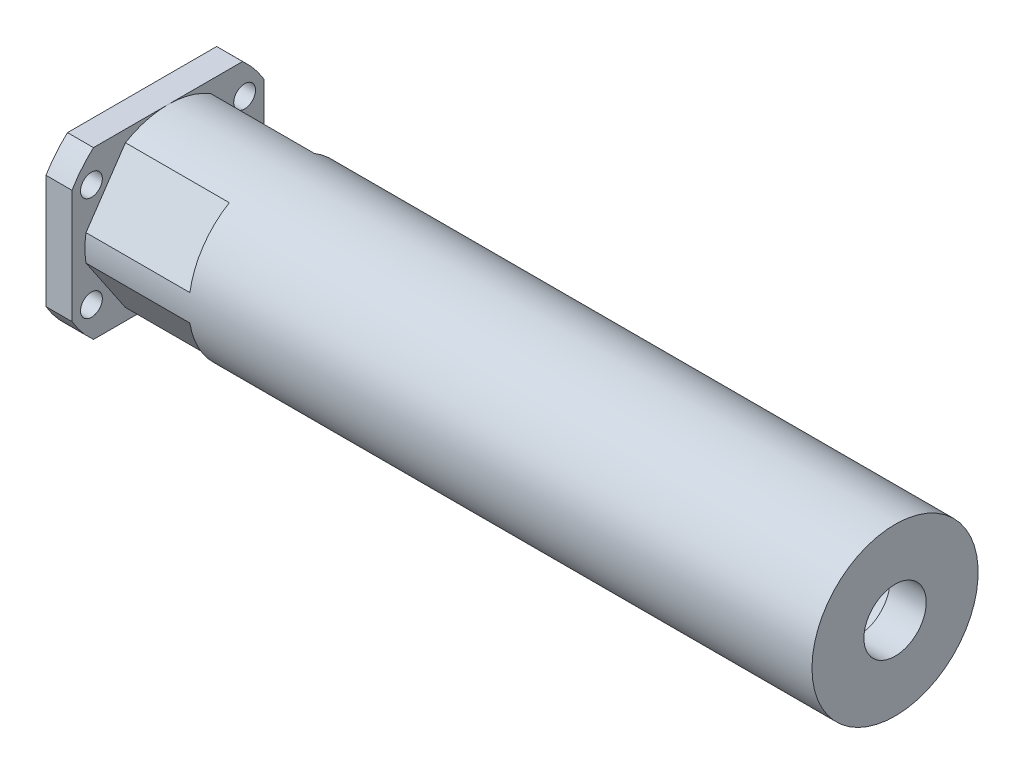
ISO-10303-21;
HEADER;
FILE_DESCRIPTION(('STEP AP214'),'2;1');
FILE_NAME('part.step','',(''),(''),'','','');
FILE_SCHEMA(('AUTOMOTIVE_DESIGN { 1 0 10303 214 1 1 1 1 }'));
ENDSEC;
DATA;
#1=APPLICATION_CONTEXT('core data for automotive mechanical design processes');
#2=APPLICATION_PROTOCOL_DEFINITION('international standard','automotive_design',2000,#1);
#3=PRODUCT_CONTEXT('',#1,'mechanical');
#4=PRODUCT('Part','Part','',(#3));
#5=PRODUCT_RELATED_PRODUCT_CATEGORY('part','',(#4));
#6=PRODUCT_DEFINITION_FORMATION('','',#4);
#7=PRODUCT_DEFINITION_CONTEXT('part definition',#1,'design');
#8=PRODUCT_DEFINITION('design','',#6,#7);
#9=PRODUCT_DEFINITION_SHAPE('','',#8);
#10=(LENGTH_UNIT() NAMED_UNIT(*) SI_UNIT(.MILLI.,.METRE.));
#11=(NAMED_UNIT(*) PLANE_ANGLE_UNIT() SI_UNIT($,.RADIAN.));
#12=(NAMED_UNIT(*) SI_UNIT($,.STERADIAN.) SOLID_ANGLE_UNIT());
#13=UNCERTAINTY_MEASURE_WITH_UNIT(LENGTH_MEASURE(1.E-05),#10,'distance_accuracy_value','');
#14=(GEOMETRIC_REPRESENTATION_CONTEXT(3) GLOBAL_UNCERTAINTY_ASSIGNED_CONTEXT((#13)) GLOBAL_UNIT_ASSIGNED_CONTEXT((#10,
#11,#12)) REPRESENTATION_CONTEXT('',''));
#15=CARTESIAN_POINT('',(0.,0.,0.));
#16=DIRECTION('',(0.,0.,1.));
#17=DIRECTION('',(1.,0.,0.));
#18=AXIS2_PLACEMENT_3D('',#15,#16,#17);
#19=CARTESIAN_POINT('',(-102.774315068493,0.,0.));
#20=DIRECTION('',(-1.,0.,0.));
#21=DIRECTION('',(0.,0.,1.));
#22=AXIS2_PLACEMENT_3D('',#19,#20,#21);
#23=CYLINDRICAL_SURFACE('',#22,13.25);
#24=CARTESIAN_POINT('',(0.,0.,0.));
#25=DIRECTION('',(-1.,0.,0.));
#26=DIRECTION('',(0.,0.,1.));
#27=AXIS2_PLACEMENT_3D('',#24,#25,#26);
#28=CIRCLE('',#27,13.25);
#29=CARTESIAN_POINT('',(0.,0.,13.25));
#30=VERTEX_POINT('',#29);
#31=EDGE_CURVE('E301',#30,#30,#28,.T.);
#32=ORIENTED_EDGE('',*,*,#31,.F.);
#33=EDGE_LOOP('',(#32));
#34=FACE_BOUND('',#33,.T.);
#35=CARTESIAN_POINT('',(-136.3,0.,0.));
#36=DIRECTION('',(-1.,0.,0.));
#37=DIRECTION('',(0.,0.,1.));
#38=AXIS2_PLACEMENT_3D('',#35,#36,#37);
#39=CIRCLE('',#38,13.25);
#40=CARTESIAN_POINT('',(-136.3,0.,13.25));
#41=VERTEX_POINT('',#40);
#42=EDGE_CURVE('E201',#41,#41,#39,.T.);
#43=ORIENTED_EDGE('',*,*,#42,.T.);
#44=EDGE_LOOP('',(#43));
#45=FACE_BOUND('',#44,.T.);
#46=ADVANCED_FACE('F63',(#34,#45),#23,.F.);
#47=CARTESIAN_POINT('',(-138.,13.2500000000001,0.));
#48=DIRECTION('',(1.,0.,0.));
#49=DIRECTION('',(0.,0.,-1.));
#50=AXIS2_PLACEMENT_3D('',#47,#48,#49);
#51=PLANE('',#50);
#52=CARTESIAN_POINT('',(-138.,-9.99984097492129,14.749765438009));
#53=DIRECTION('',(1.,0.,0.));
#54=DIRECTION('',(0.,0.,-1.));
#55=AXIS2_PLACEMENT_3D('',#52,#53,#54);
#56=CIRCLE('',#55,2.1);
#57=CARTESIAN_POINT('',(-138.,-9.99984097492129,12.649765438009));
#58=VERTEX_POINT('',#57);
#59=EDGE_CURVE('E216',#58,#58,#56,.F.);
#60=ORIENTED_EDGE('',*,*,#59,.F.);
#61=EDGE_LOOP('',(#60));
#62=FACE_BOUND('',#61,.T.);
#63=CARTESIAN_POINT('',(-138.,-7.99999999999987,-14.75));
#64=DIRECTION('',(1.,0.,0.));
#65=DIRECTION('',(0.,0.,-1.));
#66=AXIS2_PLACEMENT_3D('',#63,#64,#65);
#67=CIRCLE('',#66,2.09999999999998);
#68=CARTESIAN_POINT('',(-138.,-6.20805864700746,-13.6550359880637));
#69=VERTEX_POINT('',#68);
#70=CARTESIAN_POINT('',(-138.,-8.0595373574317,-12.6508441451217));
#71=VERTEX_POINT('',#70);
#72=EDGE_CURVE('E206',#69,#71,#67,.F.);
#73=ORIENTED_EDGE('',*,*,#72,.F.);
#74=CARTESIAN_POINT('',(-138.,0.,0.));
#75=DIRECTION('',(-1.,0.,0.));
#76=DIRECTION('',(0.,0.,1.));
#77=AXIS2_PLACEMENT_3D('',#74,#75,#76);
#78=CIRCLE('',#77,15.);
#79=EDGE_CURVE('E194',#71,#69,#78,.T.);
#80=ORIENTED_EDGE('',*,*,#79,.F.);
#81=EDGE_LOOP('',(#73,#80));
#82=FACE_BOUND('',#81,.T.);
#83=CARTESIAN_POINT('',(-138.,9.99984097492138,-14.7497654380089));
#84=DIRECTION('',(1.,0.,0.));
#85=DIRECTION('',(0.,0.,-1.));
#86=AXIS2_PLACEMENT_3D('',#83,#84,#85);
#87=CIRCLE('',#86,2.1);
#88=CARTESIAN_POINT('',(-138.,9.99984097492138,-16.8497654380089));
#89=VERTEX_POINT('',#88);
#90=EDGE_CURVE('E213',#89,#89,#87,.F.);
#91=ORIENTED_EDGE('',*,*,#90,.F.);
#92=EDGE_LOOP('',(#91));
#93=FACE_BOUND('',#92,.T.);
#94=CARTESIAN_POINT('',(-138.,9.99984097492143,14.7497654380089));
#95=DIRECTION('',(1.,0.,0.));
#96=DIRECTION('',(0.,0.,-1.));
#97=AXIS2_PLACEMENT_3D('',#94,#95,#96);
#98=CIRCLE('',#97,2.1);
#99=CARTESIAN_POINT('',(-138.,9.99984097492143,12.6497654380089));
#100=VERTEX_POINT('',#99);
#101=EDGE_CURVE('E225',#100,#100,#98,.F.);
#102=ORIENTED_EDGE('',*,*,#101,.F.);
#103=EDGE_LOOP('',(#102));
#104=FACE_BOUND('',#103,.T.);
#105=DIRECTION('',(0.,-1.,0.));
#106=VECTOR('',#105,1.);
#107=CARTESIAN_POINT('',(-138.,16.0000000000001,-18.5));
#108=LINE('',#107,#106);
#109=CARTESIAN_POINT('',(-138.,10.9544511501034,-18.5000000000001));
#110=VERTEX_POINT('',#109);
#111=CARTESIAN_POINT('',(-138.,-10.9544511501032,-18.5));
#112=VERTEX_POINT('',#111);
#113=EDGE_CURVE('E263',#110,#112,#108,.T.);
#114=ORIENTED_EDGE('',*,*,#113,.T.);
#115=CARTESIAN_POINT('',(-138.,0.,0.));
#116=DIRECTION('',(-1.,0.,0.));
#117=DIRECTION('',(0.,0.,1.));
#118=AXIS2_PLACEMENT_3D('',#115,#116,#117);
#119=CIRCLE('',#118,21.5);
#120=CARTESIAN_POINT('',(-138.,-15.9999999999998,-14.3614066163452));
#121=VERTEX_POINT('',#120);
#122=EDGE_CURVE('E460',#112,#121,#119,.T.);
#123=ORIENTED_EDGE('',*,*,#122,.T.);
#124=DIRECTION('',(0.,0.,1.));
#125=VECTOR('',#124,1.);
#126=CARTESIAN_POINT('',(-138.,-15.9999999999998,-18.5000000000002));
#127=LINE('',#126,#125);
#128=CARTESIAN_POINT('',(-138.,-15.9999999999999,14.3614066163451));
#129=VERTEX_POINT('',#128);
#130=EDGE_CURVE('E266',#121,#129,#127,.T.);
#131=ORIENTED_EDGE('',*,*,#130,.T.);
#132=CARTESIAN_POINT('',(-138.,-10.9544511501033,18.4999999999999));
#133=VERTEX_POINT('',#132);
#134=EDGE_CURVE('E317',#129,#133,#119,.T.);
#135=ORIENTED_EDGE('',*,*,#134,.T.);
#136=DIRECTION('',(0.,1.,0.));
#137=VECTOR('',#136,1.);
#138=CARTESIAN_POINT('',(-138.,16.,18.4999999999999));
#139=LINE('',#138,#137);
#140=CARTESIAN_POINT('',(-138.,10.9544511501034,18.5));
#141=VERTEX_POINT('',#140);
#142=EDGE_CURVE('E269',#133,#141,#139,.T.);
#143=ORIENTED_EDGE('',*,*,#142,.T.);
#144=CARTESIAN_POINT('',(-138.,16.,14.3614066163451));
#145=VERTEX_POINT('',#144);
#146=EDGE_CURVE('E319',#141,#145,#119,.T.);
#147=ORIENTED_EDGE('',*,*,#146,.T.);
#148=DIRECTION('',(0.,0.,-1.));
#149=VECTOR('',#148,1.);
#150=CARTESIAN_POINT('',(-138.,16.0000000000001,-18.5));
#151=LINE('',#150,#149);
#152=CARTESIAN_POINT('',(-138.,16.0000000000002,-14.3614066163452));
#153=VERTEX_POINT('',#152);
#154=EDGE_CURVE('E272',#145,#153,#151,.T.);
#155=ORIENTED_EDGE('',*,*,#154,.T.);
#156=EDGE_CURVE('E323',#153,#110,#119,.T.);
#157=ORIENTED_EDGE('',*,*,#156,.T.);
#158=EDGE_LOOP('',(#114,#123,#131,#135,#143,#147,#155,#157));
#159=FACE_BOUND('',#158,.T.);
#160=ADVANCED_FACE('F65',(#62,#82,#93,#104,#159),#51,.F.);
#161=CARTESIAN_POINT('',(-102.774315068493,0.,0.));
#162=DIRECTION('',(-1.,0.,0.));
#163=DIRECTION('',(0.,0.,1.));
#164=AXIS2_PLACEMENT_3D('',#161,#162,#163);
#165=CYLINDRICAL_SURFACE('',#164,21.5);
#166=DIRECTION('',(-1.,0.,0.));
#167=VECTOR('',#166,1.);
#168=CARTESIAN_POINT('',(-102.774315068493,-10.954451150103,-18.5));
#169=LINE('',#168,#167);
#170=CARTESIAN_POINT('',(-133.,-10.9544511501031,-18.5));
#171=VERTEX_POINT('',#170);
#172=EDGE_CURVE('E295',#171,#112,#169,.T.);
#173=ORIENTED_EDGE('',*,*,#172,.F.);
#174=CARTESIAN_POINT('',(-133.,0.,1.11022302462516E-13));
#175=DIRECTION('',(-1.,0.,0.));
#176=DIRECTION('',(0.,0.,1.));
#177=AXIS2_PLACEMENT_3D('',#174,#175,#176);
#178=CIRCLE('',#177,21.5);
#179=CARTESIAN_POINT('',(-133.,-15.9999999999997,-14.3614066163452));
#180=VERTEX_POINT('',#179);
#181=EDGE_CURVE('E468',#171,#180,#178,.T.);
#182=ORIENTED_EDGE('',*,*,#181,.T.);
#183=DIRECTION('',(-1.,0.,0.));
#184=VECTOR('',#183,1.);
#185=CARTESIAN_POINT('',(-102.774315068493,-15.9999999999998,-14.3614066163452));
#186=LINE('',#185,#184);
#187=EDGE_CURVE('E280',#121,#180,#186,.F.);
#188=ORIENTED_EDGE('',*,*,#187,.F.);
#189=ORIENTED_EDGE('',*,*,#122,.F.);
#190=EDGE_LOOP('',(#173,#182,#188,#189));
#191=FACE_BOUND('',#190,.T.);
#192=ADVANCED_FACE('F413',(#191),#165,.T.);
#193=DIRECTION('',(-1.,0.,0.));
#194=VECTOR('',#193,1.);
#195=CARTESIAN_POINT('',(-102.774315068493,10.9544511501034,-18.5000000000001));
#196=LINE('',#195,#194);
#197=CARTESIAN_POINT('',(-133.,10.9544511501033,-18.5000000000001));
#198=VERTEX_POINT('',#197);
#199=EDGE_CURVE('E293',#110,#198,#196,.F.);
#200=ORIENTED_EDGE('',*,*,#199,.F.);
#201=ORIENTED_EDGE('',*,*,#156,.F.);
#202=DIRECTION('',(-1.,0.,0.));
#203=VECTOR('',#202,1.);
#204=CARTESIAN_POINT('',(-102.774315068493,16.0000000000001,-14.3614066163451));
#205=LINE('',#204,#203);
#206=CARTESIAN_POINT('',(-133.,16.0000000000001,-14.3614066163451));
#207=VERTEX_POINT('',#206);
#208=EDGE_CURVE('E284',#207,#153,#205,.T.);
#209=ORIENTED_EDGE('',*,*,#208,.F.);
#210=EDGE_CURVE('E318',#207,#198,#178,.T.);
#211=ORIENTED_EDGE('',*,*,#210,.T.);
#212=EDGE_LOOP('',(#200,#201,#209,#211));
#213=FACE_BOUND('',#212,.T.);
#214=ADVANCED_FACE('F435',(#213),#165,.T.);
#215=DIRECTION('',(-1.,0.,0.));
#216=VECTOR('',#215,1.);
#217=CARTESIAN_POINT('',(-102.774315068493,16.,14.3614066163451));
#218=LINE('',#217,#216);
#219=CARTESIAN_POINT('',(-133.,16.,14.3614066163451));
#220=VERTEX_POINT('',#219);
#221=EDGE_CURVE('E287',#145,#220,#218,.F.);
#222=ORIENTED_EDGE('',*,*,#221,.F.);
#223=ORIENTED_EDGE('',*,*,#146,.F.);
#224=DIRECTION('',(-1.,0.,0.));
#225=VECTOR('',#224,1.);
#226=CARTESIAN_POINT('',(-102.774315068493,10.9544511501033,18.5));
#227=LINE('',#226,#225);
#228=CARTESIAN_POINT('',(-133.,10.9544511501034,18.4999999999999));
#229=VERTEX_POINT('',#228);
#230=EDGE_CURVE('E291',#229,#141,#227,.T.);
#231=ORIENTED_EDGE('',*,*,#230,.F.);
#232=EDGE_CURVE('E314',#229,#220,#178,.T.);
#233=ORIENTED_EDGE('',*,*,#232,.T.);
#234=EDGE_LOOP('',(#222,#223,#231,#233));
#235=FACE_BOUND('',#234,.T.);
#236=ADVANCED_FACE('F440',(#235),#165,.T.);
#237=DIRECTION('',(-1.,0.,0.));
#238=VECTOR('',#237,1.);
#239=CARTESIAN_POINT('',(-102.774315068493,-10.9544511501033,18.5));
#240=LINE('',#239,#238);
#241=CARTESIAN_POINT('',(-133.,-10.9544511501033,18.4999999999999));
#242=VERTEX_POINT('',#241);
#243=EDGE_CURVE('E289',#133,#242,#240,.F.);
#244=ORIENTED_EDGE('',*,*,#243,.F.);
#245=ORIENTED_EDGE('',*,*,#134,.F.);
#246=DIRECTION('',(-1.,0.,0.));
#247=VECTOR('',#246,1.);
#248=CARTESIAN_POINT('',(-102.774315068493,-16.,14.3614066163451));
#249=LINE('',#248,#247);
#250=CARTESIAN_POINT('',(-133.,-16.,14.361406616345));
#251=VERTEX_POINT('',#250);
#252=EDGE_CURVE('E277',#251,#129,#249,.T.);
#253=ORIENTED_EDGE('',*,*,#252,.F.);
#254=EDGE_CURVE('E311',#251,#242,#178,.T.);
#255=ORIENTED_EDGE('',*,*,#254,.T.);
#256=EDGE_LOOP('',(#244,#245,#253,#255));
#257=FACE_BOUND('',#256,.T.);
#258=ADVANCED_FACE('F432',(#257),#165,.T.);
#259=CARTESIAN_POINT('',(-133.,21.5,0.));
#260=DIRECTION('',(-1.,0.,0.));
#261=DIRECTION('',(0.,0.,1.));
#262=AXIS2_PLACEMENT_3D('',#259,#260,#261);
#263=PLANE('',#262);
#264=CARTESIAN_POINT('',(-133.,-7.99999999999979,-14.75));
#265=DIRECTION('',(1.,0.,0.));
#266=DIRECTION('',(0.,0.,-1.));
#267=AXIS2_PLACEMENT_3D('',#264,#265,#266);
#268=CIRCLE('',#267,2.09999999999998);
#269=CARTESIAN_POINT('',(-133.,-7.99999999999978,-16.85));
#270=VERTEX_POINT('',#269);
#271=EDGE_CURVE('E210',#270,#270,#268,.T.);
#272=ORIENTED_EDGE('',*,*,#271,.F.);
#273=EDGE_LOOP('',(#272));
#274=FACE_BOUND('',#273,.T.);
#275=CARTESIAN_POINT('',(-133.,9.99984097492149,-14.749765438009));
#276=DIRECTION('',(1.,0.,0.));
#277=DIRECTION('',(0.,0.,-1.));
#278=AXIS2_PLACEMENT_3D('',#275,#276,#277);
#279=CIRCLE('',#278,2.1);
#280=CARTESIAN_POINT('',(-133.,9.99984097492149,-16.849765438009));
#281=VERTEX_POINT('',#280);
#282=EDGE_CURVE('E209',#281,#281,#279,.T.);
#283=ORIENTED_EDGE('',*,*,#282,.F.);
#284=EDGE_LOOP('',(#283));
#285=FACE_BOUND('',#284,.T.);
#286=DIRECTION('',(0.,-1.,0.));
#287=VECTOR('',#286,1.);
#288=CARTESIAN_POINT('',(-133.,21.5000000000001,-18.5));
#289=LINE('',#288,#287);
#290=EDGE_CURVE('E327',#198,#171,#289,.T.);
#291=ORIENTED_EDGE('',*,*,#290,.F.);
#292=ORIENTED_EDGE('',*,*,#210,.F.);
#293=DIRECTION('',(0.,0.,-1.));
#294=VECTOR('',#293,1.);
#295=CARTESIAN_POINT('',(-133.,16.0000000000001,1.11022302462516E-13));
#296=LINE('',#295,#294);
#297=CARTESIAN_POINT('',(-133.,16.0000000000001,1.11022302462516E-13));
#298=VERTEX_POINT('',#297);
#299=EDGE_CURVE('E282',#298,#207,#296,.T.);
#300=ORIENTED_EDGE('',*,*,#299,.F.);
#301=CARTESIAN_POINT('',(-133.,0.,1.11022302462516E-13));
#302=DIRECTION('',(-1.,0.,0.));
#303=DIRECTION('',(0.,0.,1.));
#304=AXIS2_PLACEMENT_3D('',#301,#302,#303);
#305=CIRCLE('',#304,16.);
#306=CARTESIAN_POINT('',(-133.,13.7353119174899,-8.20616880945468));
#307=VERTEX_POINT('',#306);
#308=EDGE_CURVE('E308',#298,#307,#305,.T.);
#309=ORIENTED_EDGE('',*,*,#308,.T.);
#310=DIRECTION('',(0.,0.827708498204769,0.561158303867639));
#311=VECTOR('',#310,1.);
#312=CARTESIAN_POINT('',(-133.,13.7353119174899,-8.20616880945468));
#313=LINE('',#312,#311);
#314=CARTESIAN_POINT('',(-133.,2.53827889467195,-15.7973776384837));
#315=VERTEX_POINT('',#314);
#316=EDGE_CURVE('E234',#315,#307,#313,.T.);
#317=ORIENTED_EDGE('',*,*,#316,.F.);
#318=CARTESIAN_POINT('',(-133.,0.134268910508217,-15.9994366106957));
#319=VERTEX_POINT('',#318);
#320=EDGE_CURVE('E312',#315,#319,#305,.T.);
#321=ORIENTED_EDGE('',*,*,#320,.T.);
#322=DIRECTION('',(0.,0.879031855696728,-0.476763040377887));
#323=VECTOR('',#322,1.);
#324=CARTESIAN_POINT('',(-133.,0.134268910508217,-15.9994366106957));
#325=LINE('',#324,#323);
#326=CARTESIAN_POINT('',(-133.,-13.4836340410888,-8.61345534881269));
#327=VERTEX_POINT('',#326);
#328=EDGE_CURVE('E232',#327,#319,#325,.T.);
#329=ORIENTED_EDGE('',*,*,#328,.F.);
#330=CARTESIAN_POINT('',(-133.,-16.,-1.11022302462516E-13));
#331=VERTEX_POINT('',#330);
#332=EDGE_CURVE('E359',#327,#331,#305,.T.);
#333=ORIENTED_EDGE('',*,*,#332,.T.);
#334=DIRECTION('',(0.,0.,1.));
#335=VECTOR('',#334,1.);
#336=CARTESIAN_POINT('',(-133.,-16.,-1.11022302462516E-13));
#337=LINE('',#336,#335);
#338=EDGE_CURVE('E278',#180,#331,#337,.T.);
#339=ORIENTED_EDGE('',*,*,#338,.F.);
#340=ORIENTED_EDGE('',*,*,#181,.F.);
#341=EDGE_LOOP('',(#291,#292,#300,#309,#317,#321,#329,#333,#339,#340));
#342=FACE_BOUND('',#341,.T.);
#343=ADVANCED_FACE('F357',(#274,#285,#342),#263,.F.);
#344=CARTESIAN_POINT('',(-133.,-9.99984097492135,14.749765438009));
#345=DIRECTION('',(1.,0.,0.));
#346=DIRECTION('',(0.,0.,-1.));
#347=AXIS2_PLACEMENT_3D('',#344,#345,#346);
#348=CIRCLE('',#347,2.1);
#349=CARTESIAN_POINT('',(-133.,-9.99984097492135,12.649765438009));
#350=VERTEX_POINT('',#349);
#351=EDGE_CURVE('E604',#350,#350,#348,.T.);
#352=ORIENTED_EDGE('',*,*,#351,.F.);
#353=EDGE_LOOP('',(#352));
#354=FACE_BOUND('',#353,.T.);
#355=CARTESIAN_POINT('',(-133.,9.99984097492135,14.7497654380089));
#356=DIRECTION('',(1.,0.,0.));
#357=DIRECTION('',(0.,0.,-1.));
#358=AXIS2_PLACEMENT_3D('',#355,#356,#357);
#359=CIRCLE('',#358,2.1);
#360=CARTESIAN_POINT('',(-133.,9.99984097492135,12.6497654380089));
#361=VERTEX_POINT('',#360);
#362=EDGE_CURVE('E222',#361,#361,#359,.T.);
#363=ORIENTED_EDGE('',*,*,#362,.F.);
#364=EDGE_LOOP('',(#363));
#365=FACE_BOUND('',#364,.T.);
#366=EDGE_CURVE('E285',#220,#298,#296,.T.);
#367=ORIENTED_EDGE('',*,*,#366,.F.);
#368=ORIENTED_EDGE('',*,*,#232,.F.);
#369=DIRECTION('',(0.,1.,0.));
#370=VECTOR('',#369,1.);
#371=CARTESIAN_POINT('',(-133.,21.5,18.5));
#372=LINE('',#371,#370);
#373=EDGE_CURVE('E322',#242,#229,#372,.T.);
#374=ORIENTED_EDGE('',*,*,#373,.F.);
#375=ORIENTED_EDGE('',*,*,#254,.F.);
#376=EDGE_CURVE('E275',#331,#251,#337,.T.);
#377=ORIENTED_EDGE('',*,*,#376,.F.);
#378=CARTESIAN_POINT('',(-133.,-13.7353119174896,8.20616880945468));
#379=VERTEX_POINT('',#378);
#380=EDGE_CURVE('E313',#331,#379,#305,.T.);
#381=ORIENTED_EDGE('',*,*,#380,.T.);
#382=DIRECTION('',(0.,-0.827708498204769,-0.561158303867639));
#383=VECTOR('',#382,1.);
#384=CARTESIAN_POINT('',(-133.,-13.7353119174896,8.20616880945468));
#385=LINE('',#384,#383);
#386=CARTESIAN_POINT('',(-133.,-2.53827889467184,15.7973776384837));
#387=VERTEX_POINT('',#386);
#388=EDGE_CURVE('E230',#387,#379,#385,.T.);
#389=ORIENTED_EDGE('',*,*,#388,.F.);
#390=CARTESIAN_POINT('',(-133.,2.5382788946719,15.7973776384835));
#391=VERTEX_POINT('',#390);
#392=EDGE_CURVE('E364',#387,#391,#305,.T.);
#393=ORIENTED_EDGE('',*,*,#392,.T.);
#394=DIRECTION('',(0.,-0.827708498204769,0.56115830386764));
#395=VECTOR('',#394,1.);
#396=CARTESIAN_POINT('',(-133.,13.7353119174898,8.20616880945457));
#397=LINE('',#396,#395);
#398=CARTESIAN_POINT('',(-133.,13.7353119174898,8.20616880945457));
#399=VERTEX_POINT('',#398);
#400=EDGE_CURVE('E228',#399,#391,#397,.T.);
#401=ORIENTED_EDGE('',*,*,#400,.F.);
#402=EDGE_CURVE('E307',#399,#298,#305,.T.);
#403=ORIENTED_EDGE('',*,*,#402,.T.);
#404=EDGE_LOOP('',(#367,#368,#374,#375,#377,#381,#389,#393,#401,#403));
#405=FACE_BOUND('',#404,.T.);
#406=ADVANCED_FACE('F372',(#354,#365,#405),#263,.F.);
#407=CARTESIAN_POINT('',(-102.774315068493,0.,0.));
#408=DIRECTION('',(-1.,0.,0.));
#409=DIRECTION('',(0.,0.,1.));
#410=AXIS2_PLACEMENT_3D('',#407,#408,#409);
#411=CYLINDRICAL_SURFACE('',#410,16.);
#412=CARTESIAN_POINT('',(-113.,0.,0.));
#413=DIRECTION('',(1.,0.,0.));
#414=DIRECTION('',(0.,0.,-1.));
#415=AXIS2_PLACEMENT_3D('',#412,#413,#414);
#416=CIRCLE('',#415,16.);
#417=CARTESIAN_POINT('',(-113.,2.53827889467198,-15.7973776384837));
#418=VERTEX_POINT('',#417);
#419=CARTESIAN_POINT('',(-113.,13.7353119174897,-8.20616880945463));
#420=VERTEX_POINT('',#419);
#421=EDGE_CURVE('E329',#418,#420,#416,.T.);
#422=ORIENTED_EDGE('',*,*,#421,.T.);
#423=DIRECTION('',(-1.,0.,0.));
#424=VECTOR('',#423,1.);
#425=CARTESIAN_POINT('',(-113.,13.7353119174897,-8.20616880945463));
#426=LINE('',#425,#424);
#427=EDGE_CURVE('E243',#420,#307,#426,.T.);
#428=ORIENTED_EDGE('',*,*,#427,.T.);
#429=ORIENTED_EDGE('',*,*,#308,.F.);
#430=ORIENTED_EDGE('',*,*,#402,.F.);
#431=DIRECTION('',(-1.,0.,0.));
#432=VECTOR('',#431,1.);
#433=CARTESIAN_POINT('',(-113.,13.7353119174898,8.20616880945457));
#434=LINE('',#433,#432);
#435=CARTESIAN_POINT('',(-113.,13.7353119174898,8.20616880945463));
#436=VERTEX_POINT('',#435);
#437=EDGE_CURVE('E261',#436,#399,#434,.T.);
#438=ORIENTED_EDGE('',*,*,#437,.F.);
#439=CARTESIAN_POINT('',(-113.,2.53827889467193,15.7973776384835));
#440=VERTEX_POINT('',#439);
#441=EDGE_CURVE('E333',#436,#440,#416,.T.);
#442=ORIENTED_EDGE('',*,*,#441,.T.);
#443=DIRECTION('',(-1.,0.,0.));
#444=VECTOR('',#443,1.);
#445=CARTESIAN_POINT('',(-113.,2.53827889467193,15.7973776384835));
#446=LINE('',#445,#444);
#447=EDGE_CURVE('E258',#440,#391,#446,.T.);
#448=ORIENTED_EDGE('',*,*,#447,.T.);
#449=ORIENTED_EDGE('',*,*,#392,.F.);
#450=DIRECTION('',(-1.,0.,0.));
#451=VECTOR('',#450,1.);
#452=CARTESIAN_POINT('',(-113.,-2.53827889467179,15.7973776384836));
#453=LINE('',#452,#451);
#454=CARTESIAN_POINT('',(-113.,-2.53827889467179,15.7973776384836));
#455=VERTEX_POINT('',#454);
#456=EDGE_CURVE('E256',#455,#387,#453,.T.);
#457=ORIENTED_EDGE('',*,*,#456,.F.);
#458=CARTESIAN_POINT('',(-113.,-13.7353119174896,8.20616880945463));
#459=VERTEX_POINT('',#458);
#460=EDGE_CURVE('E335',#455,#459,#416,.T.);
#461=ORIENTED_EDGE('',*,*,#460,.T.);
#462=DIRECTION('',(-1.,0.,0.));
#463=VECTOR('',#462,1.);
#464=CARTESIAN_POINT('',(-113.,-13.7353119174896,8.20616880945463));
#465=LINE('',#464,#463);
#466=EDGE_CURVE('E253',#459,#379,#465,.T.);
#467=ORIENTED_EDGE('',*,*,#466,.T.);
#468=ORIENTED_EDGE('',*,*,#380,.F.);
#469=ORIENTED_EDGE('',*,*,#332,.F.);
#470=DIRECTION('',(-1.,0.,0.));
#471=VECTOR('',#470,1.);
#472=CARTESIAN_POINT('',(-113.,-13.4836340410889,-8.61345534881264));
#473=LINE('',#472,#471);
#474=CARTESIAN_POINT('',(-113.,-13.4836340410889,-8.61345534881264));
#475=VERTEX_POINT('',#474);
#476=EDGE_CURVE('E251',#475,#327,#473,.T.);
#477=ORIENTED_EDGE('',*,*,#476,.F.);
#478=CARTESIAN_POINT('',(-113.,0.134268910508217,-15.9994366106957));
#479=VERTEX_POINT('',#478);
#480=EDGE_CURVE('E332',#475,#479,#416,.T.);
#481=ORIENTED_EDGE('',*,*,#480,.T.);
#482=DIRECTION('',(-1.,0.,0.));
#483=VECTOR('',#482,1.);
#484=CARTESIAN_POINT('',(-113.,0.134268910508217,-15.9994366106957));
#485=LINE('',#484,#483);
#486=EDGE_CURVE('E248',#479,#319,#485,.T.);
#487=ORIENTED_EDGE('',*,*,#486,.T.);
#488=ORIENTED_EDGE('',*,*,#320,.F.);
#489=DIRECTION('',(-1.,0.,0.));
#490=VECTOR('',#489,1.);
#491=CARTESIAN_POINT('',(-113.,2.53827889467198,-15.7973776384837));
#492=LINE('',#491,#490);
#493=EDGE_CURVE('E246',#418,#315,#492,.T.);
#494=ORIENTED_EDGE('',*,*,#493,.F.);
#495=EDGE_LOOP('',(#422,#428,#429,#430,#438,#442,#448,#449,#457,#461,#467,#468,#469,#477,#481,
#487,#488,#494));
#496=FACE_BOUND('',#495,.T.);
#497=CARTESIAN_POINT('',(7.00000000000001,0.,0.));
#498=DIRECTION('',(-1.,0.,0.));
#499=DIRECTION('',(0.,0.,1.));
#500=AXIS2_PLACEMENT_3D('',#497,#498,#499);
#501=CIRCLE('',#500,16.);
#502=CARTESIAN_POINT('',(7.00000000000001,0.,16.));
#503=VERTEX_POINT('',#502);
#504=EDGE_CURVE('E304',#503,#503,#501,.T.);
#505=ORIENTED_EDGE('',*,*,#504,.T.);
#506=EDGE_LOOP('',(#505));
#507=FACE_BOUND('',#506,.T.);
#508=ADVANCED_FACE('F344',(#496,#507),#411,.T.);
#509=CARTESIAN_POINT('',(6.99999999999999,16.0000000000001,0.));
#510=DIRECTION('',(-1.,0.,0.));
#511=DIRECTION('',(0.,0.,1.));
#512=AXIS2_PLACEMENT_3D('',#509,#510,#511);
#513=PLANE('',#512);
#514=CARTESIAN_POINT('',(7.00000000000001,0.,0.));
#515=DIRECTION('',(1.,0.,0.));
#516=DIRECTION('',(0.,0.,-1.));
#517=AXIS2_PLACEMENT_3D('',#514,#515,#516);
#518=CIRCLE('',#517,5.99999999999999);
#519=CARTESIAN_POINT('',(7.00000000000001,0.,-5.99999999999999));
#520=VERTEX_POINT('',#519);
#521=EDGE_CURVE('E297',#520,#520,#518,.T.);
#522=ORIENTED_EDGE('',*,*,#521,.F.);
#523=EDGE_LOOP('',(#522));
#524=FACE_BOUND('',#523,.T.);
#525=ORIENTED_EDGE('',*,*,#504,.F.);
#526=EDGE_LOOP('',(#525));
#527=FACE_BOUND('',#526,.T.);
#528=ADVANCED_FACE('F424',(#524,#527),#513,.F.);
#529=CARTESIAN_POINT('',(0.,0.,0.));
#530=DIRECTION('',(1.,0.,0.));
#531=DIRECTION('',(0.,0.,-1.));
#532=AXIS2_PLACEMENT_3D('',#529,#530,#531);
#533=PLANE('',#532);
#534=CARTESIAN_POINT('',(0.,0.,0.));
#535=DIRECTION('',(1.,0.,0.));
#536=DIRECTION('',(0.,0.,-1.));
#537=AXIS2_PLACEMENT_3D('',#534,#535,#536);
#538=CIRCLE('',#537,5.99999999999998);
#539=CARTESIAN_POINT('',(0.,0.,-5.99999999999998));
#540=VERTEX_POINT('',#539);
#541=EDGE_CURVE('E300',#540,#540,#538,.T.);
#542=ORIENTED_EDGE('',*,*,#541,.T.);
#543=EDGE_LOOP('',(#542));
#544=FACE_BOUND('',#543,.T.);
#545=ORIENTED_EDGE('',*,*,#31,.T.);
#546=EDGE_LOOP('',(#545));
#547=FACE_BOUND('',#546,.T.);
#548=ADVANCED_FACE('F421',(#544,#547),#533,.F.);
#549=CARTESIAN_POINT('',(7.00000000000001,0.,0.));
#550=DIRECTION('',(1.,0.,0.));
#551=DIRECTION('',(0.,0.,-1.));
#552=AXIS2_PLACEMENT_3D('',#549,#550,#551);
#553=CYLINDRICAL_SURFACE('',#552,5.99999999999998);
#554=ORIENTED_EDGE('',*,*,#521,.T.);
#555=EDGE_LOOP('',(#554));
#556=FACE_BOUND('',#555,.T.);
#557=ORIENTED_EDGE('',*,*,#541,.F.);
#558=EDGE_LOOP('',(#557));
#559=FACE_BOUND('',#558,.T.);
#560=ADVANCED_FACE('F419',(#556,#559),#553,.F.);
#561=CARTESIAN_POINT('',(7.00000000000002,-15.9999999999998,-18.5000000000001));
#562=DIRECTION('',(0.,-1.,0.));
#563=DIRECTION('',(0.,0.,-1.));
#564=AXIS2_PLACEMENT_3D('',#561,#562,#563);
#565=PLANE('',#564);
#566=ORIENTED_EDGE('',*,*,#187,.T.);
#567=ORIENTED_EDGE('',*,*,#338,.T.);
#568=ORIENTED_EDGE('',*,*,#376,.T.);
#569=ORIENTED_EDGE('',*,*,#252,.T.);
#570=ORIENTED_EDGE('',*,*,#130,.F.);
#571=EDGE_LOOP('',(#566,#567,#568,#569,#570));
#572=FACE_BOUND('',#571,.T.);
#573=ADVANCED_FACE('F471',(#572),#565,.T.);
#574=CARTESIAN_POINT('',(6.99999999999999,16.,18.5));
#575=DIRECTION('',(0.,0.,1.));
#576=DIRECTION('',(0.,-1.,0.));
#577=AXIS2_PLACEMENT_3D('',#574,#575,#576);
#578=PLANE('',#577);
#579=ORIENTED_EDGE('',*,*,#230,.T.);
#580=ORIENTED_EDGE('',*,*,#142,.F.);
#581=ORIENTED_EDGE('',*,*,#243,.T.);
#582=ORIENTED_EDGE('',*,*,#373,.T.);
#583=EDGE_LOOP('',(#579,#580,#581,#582));
#584=FACE_BOUND('',#583,.T.);
#585=ADVANCED_FACE('F474',(#584),#578,.T.);
#586=CARTESIAN_POINT('',(6.99999999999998,16.0000000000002,-18.5));
#587=DIRECTION('',(0.,1.,0.));
#588=DIRECTION('',(0.,0.,1.));
#589=AXIS2_PLACEMENT_3D('',#586,#587,#588);
#590=PLANE('',#589);
#591=ORIENTED_EDGE('',*,*,#221,.T.);
#592=ORIENTED_EDGE('',*,*,#366,.T.);
#593=ORIENTED_EDGE('',*,*,#299,.T.);
#594=ORIENTED_EDGE('',*,*,#208,.T.);
#595=ORIENTED_EDGE('',*,*,#154,.F.);
#596=EDGE_LOOP('',(#591,#592,#593,#594,#595));
#597=FACE_BOUND('',#596,.T.);
#598=ADVANCED_FACE('F377',(#597),#590,.T.);
#599=CARTESIAN_POINT('',(6.99999999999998,16.0000000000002,-18.5));
#600=DIRECTION('',(0.,0.,-1.));
#601=DIRECTION('',(0.,1.,0.));
#602=AXIS2_PLACEMENT_3D('',#599,#600,#601);
#603=PLANE('',#602);
#604=ORIENTED_EDGE('',*,*,#172,.T.);
#605=ORIENTED_EDGE('',*,*,#113,.F.);
#606=ORIENTED_EDGE('',*,*,#199,.T.);
#607=ORIENTED_EDGE('',*,*,#290,.T.);
#608=EDGE_LOOP('',(#604,#605,#606,#607));
#609=FACE_BOUND('',#608,.T.);
#610=ADVANCED_FACE('F397',(#609),#603,.T.);
#611=CARTESIAN_POINT('',(-113.,13.7353119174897,-8.20616880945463));
#612=DIRECTION('',(0.,-0.56115830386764,0.827708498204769));
#613=DIRECTION('',(0.,-0.827708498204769,-0.561158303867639));
#614=AXIS2_PLACEMENT_3D('',#611,#612,#613);
#615=PLANE('',#614);
#616=ORIENTED_EDGE('',*,*,#316,.T.);
#617=ORIENTED_EDGE('',*,*,#427,.F.);
#618=DIRECTION('',(0.,0.827708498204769,0.561158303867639));
#619=VECTOR('',#618,1.);
#620=CARTESIAN_POINT('',(-113.,13.7353119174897,-8.20616880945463));
#621=LINE('',#620,#619);
#622=EDGE_CURVE('E241',#418,#420,#621,.T.);
#623=ORIENTED_EDGE('',*,*,#622,.F.);
#624=ORIENTED_EDGE('',*,*,#493,.T.);
#625=EDGE_LOOP('',(#616,#617,#623,#624));
#626=FACE_BOUND('',#625,.T.);
#627=ADVANCED_FACE('F386',(#626),#615,.F.);
#628=CARTESIAN_POINT('',(-113.,0.,0.));
#629=DIRECTION('',(1.,0.,0.));
#630=DIRECTION('',(0.,0.,-1.));
#631=AXIS2_PLACEMENT_3D('',#628,#629,#630);
#632=PLANE('',#631);
#633=ORIENTED_EDGE('',*,*,#622,.T.);
#634=ORIENTED_EDGE('',*,*,#421,.F.);
#635=EDGE_LOOP('',(#633,#634));
#636=FACE_BOUND('',#635,.T.);
#637=ADVANCED_FACE('F388',(#636),#632,.F.);
#638=CARTESIAN_POINT('',(-113.,0.134268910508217,-15.9994366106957));
#639=DIRECTION('',(0.,0.476763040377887,0.879031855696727));
#640=DIRECTION('',(0.,-0.879031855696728,0.476763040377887));
#641=AXIS2_PLACEMENT_3D('',#638,#639,#640);
#642=PLANE('',#641);
#643=ORIENTED_EDGE('',*,*,#328,.T.);
#644=ORIENTED_EDGE('',*,*,#486,.F.);
#645=DIRECTION('',(0.,0.879031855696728,-0.476763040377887));
#646=VECTOR('',#645,1.);
#647=CARTESIAN_POINT('',(-113.,0.134268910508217,-15.9994366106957));
#648=LINE('',#647,#646);
#649=EDGE_CURVE('E239',#475,#479,#648,.T.);
#650=ORIENTED_EDGE('',*,*,#649,.F.);
#651=ORIENTED_EDGE('',*,*,#476,.T.);
#652=EDGE_LOOP('',(#643,#644,#650,#651));
#653=FACE_BOUND('',#652,.T.);
#654=ADVANCED_FACE('F353',(#653),#642,.F.);
#655=ORIENTED_EDGE('',*,*,#649,.T.);
#656=ORIENTED_EDGE('',*,*,#480,.F.);
#657=EDGE_LOOP('',(#655,#656));
#658=FACE_BOUND('',#657,.T.);
#659=ADVANCED_FACE('F351',(#658),#632,.F.);
#660=CARTESIAN_POINT('',(-113.,-13.7353119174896,8.20616880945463));
#661=DIRECTION('',(0.,0.56115830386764,-0.827708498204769));
#662=DIRECTION('',(0.,0.827708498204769,0.561158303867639));
#663=AXIS2_PLACEMENT_3D('',#660,#661,#662);
#664=PLANE('',#663);
#665=ORIENTED_EDGE('',*,*,#388,.T.);
#666=ORIENTED_EDGE('',*,*,#466,.F.);
#667=DIRECTION('',(0.,-0.827708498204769,-0.561158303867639));
#668=VECTOR('',#667,1.);
#669=CARTESIAN_POINT('',(-113.,-13.7353119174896,8.20616880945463));
#670=LINE('',#669,#668);
#671=EDGE_CURVE('E237',#455,#459,#670,.T.);
#672=ORIENTED_EDGE('',*,*,#671,.F.);
#673=ORIENTED_EDGE('',*,*,#456,.T.);
#674=EDGE_LOOP('',(#665,#666,#672,#673));
#675=FACE_BOUND('',#674,.T.);
#676=ADVANCED_FACE('F406',(#675),#664,.F.);
#677=ORIENTED_EDGE('',*,*,#671,.T.);
#678=ORIENTED_EDGE('',*,*,#460,.F.);
#679=EDGE_LOOP('',(#677,#678));
#680=FACE_BOUND('',#679,.T.);
#681=ADVANCED_FACE('F403',(#680),#632,.F.);
#682=DIRECTION('',(0.,-0.827708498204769,0.56115830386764));
#683=VECTOR('',#682,1.);
#684=CARTESIAN_POINT('',(-113.,13.7353119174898,8.20616880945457));
#685=LINE('',#684,#683);
#686=EDGE_CURVE('E85',#436,#440,#685,.T.);
#687=ORIENTED_EDGE('',*,*,#686,.T.);
#688=ORIENTED_EDGE('',*,*,#441,.F.);
#689=EDGE_LOOP('',(#687,#688));
#690=FACE_BOUND('',#689,.T.);
#691=ADVANCED_FACE('F391',(#690),#632,.F.);
#692=CARTESIAN_POINT('',(-113.,13.7353119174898,8.20616880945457));
#693=DIRECTION('',(0.,-0.561158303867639,-0.827708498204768));
#694=DIRECTION('',(0.,0.827708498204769,-0.56115830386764));
#695=AXIS2_PLACEMENT_3D('',#692,#693,#694);
#696=PLANE('',#695);
#697=ORIENTED_EDGE('',*,*,#400,.T.);
#698=ORIENTED_EDGE('',*,*,#447,.F.);
#699=ORIENTED_EDGE('',*,*,#686,.F.);
#700=ORIENTED_EDGE('',*,*,#437,.T.);
#701=EDGE_LOOP('',(#697,#698,#699,#700));
#702=FACE_BOUND('',#701,.T.);
#703=ADVANCED_FACE('F402',(#702),#696,.F.);
#704=CARTESIAN_POINT('',(-138.001,9.99984097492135,14.749765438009));
#705=DIRECTION('',(1.,0.,0.));
#706=DIRECTION('',(0.,0.,-1.));
#707=AXIS2_PLACEMENT_3D('',#704,#705,#706);
#708=CYLINDRICAL_SURFACE('',#707,2.1);
#709=ORIENTED_EDGE('',*,*,#362,.T.);
#710=EDGE_LOOP('',(#709));
#711=FACE_BOUND('',#710,.T.);
#712=ORIENTED_EDGE('',*,*,#101,.T.);
#713=EDGE_LOOP('',(#712));
#714=FACE_BOUND('',#713,.T.);
#715=ADVANCED_FACE('F540',(#711,#714),#708,.F.);
#716=CARTESIAN_POINT('',(-138.001,9.99984097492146,-14.749765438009));
#717=DIRECTION('',(1.,0.,0.));
#718=DIRECTION('',(0.,0.,-1.));
#719=AXIS2_PLACEMENT_3D('',#716,#717,#718);
#720=CYLINDRICAL_SURFACE('',#719,2.1);
#721=ORIENTED_EDGE('',*,*,#282,.T.);
#722=EDGE_LOOP('',(#721));
#723=FACE_BOUND('',#722,.T.);
#724=ORIENTED_EDGE('',*,*,#90,.T.);
#725=EDGE_LOOP('',(#724));
#726=FACE_BOUND('',#725,.T.);
#727=ADVANCED_FACE('F548',(#723,#726),#720,.F.);
#728=CARTESIAN_POINT('',(-138.001,-7.99999999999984,-14.75));
#729=DIRECTION('',(1.,0.,0.));
#730=DIRECTION('',(0.,0.,-1.));
#731=AXIS2_PLACEMENT_3D('',#728,#729,#730);
#732=CYLINDRICAL_SURFACE('',#731,2.09999999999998);
#733=ORIENTED_EDGE('',*,*,#72,.T.);
#734=DIRECTION('',(-1.,0.,0.));
#735=VECTOR('',#734,1.);
#736=CARTESIAN_POINT('',(-137.15,-8.05953735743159,-12.6508441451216));
#737=LINE('',#736,#735);
#738=CARTESIAN_POINT('',(-136.3,-8.05953735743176,-12.6508441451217));
#739=VERTEX_POINT('',#738);
#740=EDGE_CURVE('E12',#71,#739,#737,.F.);
#741=ORIENTED_EDGE('',*,*,#740,.T.);
#742=CARTESIAN_POINT('',(-136.3,-7.99999999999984,-14.7500000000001));
#743=DIRECTION('',(-1.,0.,0.));
#744=DIRECTION('',(0.,0.,1.));
#745=AXIS2_PLACEMENT_3D('',#742,#743,#744);
#746=CIRCLE('',#745,2.09999999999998);
#747=CARTESIAN_POINT('',(-136.3,-6.20805864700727,-13.6550359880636));
#748=VERTEX_POINT('',#747);
#749=EDGE_CURVE('E207',#748,#739,#746,.F.);
#750=ORIENTED_EDGE('',*,*,#749,.F.);
#751=DIRECTION('',(-1.,0.,0.));
#752=VECTOR('',#751,1.);
#753=CARTESIAN_POINT('',(-137.15,-6.20805864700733,-13.6550359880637));
#754=LINE('',#753,#752);
#755=EDGE_CURVE('E71',#748,#69,#754,.T.);
#756=ORIENTED_EDGE('',*,*,#755,.T.);
#757=EDGE_LOOP('',(#733,#741,#750,#756));
#758=FACE_BOUND('',#757,.T.);
#759=ORIENTED_EDGE('',*,*,#271,.T.);
#760=EDGE_LOOP('',(#759));
#761=FACE_BOUND('',#760,.T.);
#762=ADVANCED_FACE('F204',(#758,#761),#732,.F.);
#763=CARTESIAN_POINT('',(-138.001,-9.99984097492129,14.7497654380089));
#764=DIRECTION('',(1.,0.,0.));
#765=DIRECTION('',(0.,0.,-1.));
#766=AXIS2_PLACEMENT_3D('',#763,#764,#765);
#767=CYLINDRICAL_SURFACE('',#766,2.1);
#768=ORIENTED_EDGE('',*,*,#351,.T.);
#769=EDGE_LOOP('',(#768));
#770=FACE_BOUND('',#769,.T.);
#771=ORIENTED_EDGE('',*,*,#59,.T.);
#772=EDGE_LOOP('',(#771));
#773=FACE_BOUND('',#772,.T.);
#774=ADVANCED_FACE('F567',(#770,#773),#767,.F.);
#775=CARTESIAN_POINT('',(-136.3,0.,0.));
#776=DIRECTION('',(-1.,0.,0.));
#777=DIRECTION('',(0.,0.,1.));
#778=AXIS2_PLACEMENT_3D('',#775,#776,#777);
#779=CYLINDRICAL_SURFACE('',#778,15.);
#780=ORIENTED_EDGE('',*,*,#79,.T.);
#781=ORIENTED_EDGE('',*,*,#755,.F.);
#782=CARTESIAN_POINT('',(-136.3,0.,0.));
#783=DIRECTION('',(-1.,0.,0.));
#784=DIRECTION('',(0.,0.,1.));
#785=AXIS2_PLACEMENT_3D('',#782,#783,#784);
#786=CIRCLE('',#785,15.);
#787=EDGE_CURVE('E77',#739,#748,#786,.T.);
#788=ORIENTED_EDGE('',*,*,#787,.F.);
#789=ORIENTED_EDGE('',*,*,#740,.F.);
#790=EDGE_LOOP('',(#780,#781,#788,#789));
#791=FACE_BOUND('',#790,.T.);
#792=ADVANCED_FACE('F196',(#791),#779,.F.);
#793=CARTESIAN_POINT('',(-136.3,0.,0.));
#794=DIRECTION('',(-1.,0.,0.));
#795=DIRECTION('',(0.,0.,1.));
#796=AXIS2_PLACEMENT_3D('',#793,#794,#795);
#797=PLANE('',#796);
#798=ORIENTED_EDGE('',*,*,#42,.F.);
#799=EDGE_LOOP('',(#798));
#800=FACE_BOUND('',#799,.T.);
#801=ORIENTED_EDGE('',*,*,#749,.T.);
#802=ORIENTED_EDGE('',*,*,#787,.T.);
#803=EDGE_LOOP('',(#801,#802));
#804=FACE_BOUND('',#803,.T.);
#805=ADVANCED_FACE('F586',(#800,#804),#797,.T.);
#806=CLOSED_SHELL('',(#46,#160,#192,#214,#236,#258,#343,#406,#508,#528,#548,#560,#573,#585,#598,
#610,#627,#637,#654,#659,#676,#681,#691,#703,#715,#727,#762,#774,#792,#805));
#807=MANIFOLD_SOLID_BREP('B2',#806);
#808=ADVANCED_BREP_SHAPE_REPRESENTATION('',(#18,#807),#14);
#809=SHAPE_DEFINITION_REPRESENTATION(#9,#808);
ENDSEC;
END-ISO-10303-21;
